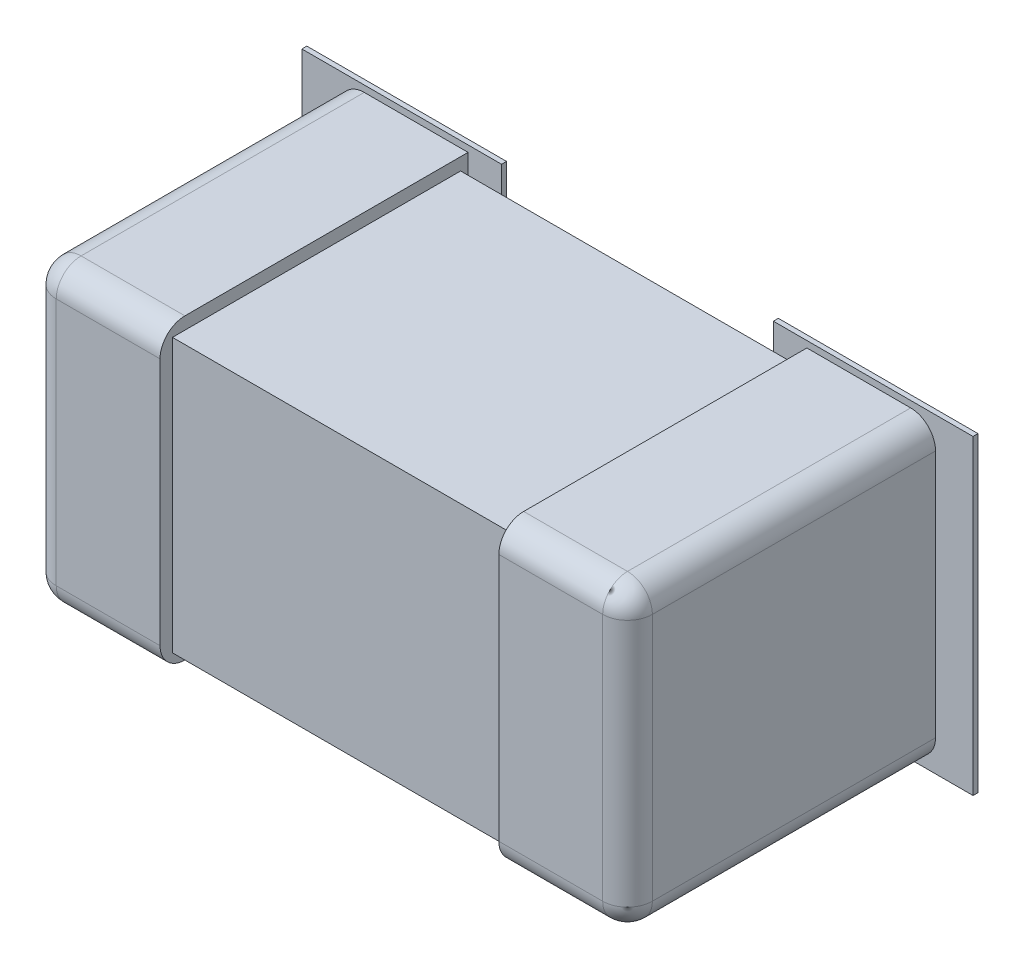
ISO-10303-21;
HEADER;
FILE_DESCRIPTION(('STEP AP214'),'2;1');
FILE_NAME('part.step','',(''),(''),'','','');
FILE_SCHEMA(('AUTOMOTIVE_DESIGN { 1 0 10303 214 1 1 1 1 }'));
ENDSEC;
DATA;
#1=APPLICATION_CONTEXT('core data for automotive mechanical design processes');
#2=APPLICATION_PROTOCOL_DEFINITION('international standard','automotive_design',2000,#1);
#3=PRODUCT_CONTEXT('',#1,'mechanical');
#4=PRODUCT('Part','Part','',(#3));
#5=PRODUCT_RELATED_PRODUCT_CATEGORY('part','',(#4));
#6=PRODUCT_DEFINITION_FORMATION('','',#4);
#7=PRODUCT_DEFINITION_CONTEXT('part definition',#1,'design');
#8=PRODUCT_DEFINITION('design','',#6,#7);
#9=PRODUCT_DEFINITION_SHAPE('','',#8);
#10=(LENGTH_UNIT() NAMED_UNIT(*) SI_UNIT(.MILLI.,.METRE.));
#11=(NAMED_UNIT(*) PLANE_ANGLE_UNIT() SI_UNIT($,.RADIAN.));
#12=(NAMED_UNIT(*) SI_UNIT($,.STERADIAN.) SOLID_ANGLE_UNIT());
#13=UNCERTAINTY_MEASURE_WITH_UNIT(LENGTH_MEASURE(1.E-05),#10,'distance_accuracy_value','');
#14=(GEOMETRIC_REPRESENTATION_CONTEXT(3) GLOBAL_UNCERTAINTY_ASSIGNED_CONTEXT((#13)) GLOBAL_UNIT_ASSIGNED_CONTEXT((#10,
#11,#12)) REPRESENTATION_CONTEXT('',''));
#15=CARTESIAN_POINT('',(0.,0.,0.));
#16=DIRECTION('',(0.,0.,1.));
#17=DIRECTION('',(1.,0.,0.));
#18=AXIS2_PLACEMENT_3D('',#15,#16,#17);
#19=CARTESIAN_POINT('',(0.,0.,0.0762));
#20=DIRECTION('',(0.,0.,1.));
#21=DIRECTION('',(1.,0.,0.));
#22=AXIS2_PLACEMENT_3D('',#19,#20,#21);
#23=PLANE('',#22);
#24=DIRECTION('',(1.,0.,0.));
#25=VECTOR('',#24,1.);
#26=CARTESIAN_POINT('',(0.138938,-0.159004,0.0762));
#27=LINE('',#26,#25);
#28=CARTESIAN_POINT('',(0.138938,-0.159004,0.0762));
#29=VERTEX_POINT('',#28);
#30=CARTESIAN_POINT('',(0.343154,-0.159004,0.0762));
#31=VERTEX_POINT('',#30);
#32=EDGE_CURVE('E330',#29,#31,#27,.T.);
#33=ORIENTED_EDGE('',*,*,#32,.F.);
#34=DIRECTION('',(0.,1.,0.));
#35=VECTOR('',#34,1.);
#36=CARTESIAN_POINT('',(0.138938,0.159004,0.0762));
#37=LINE('',#36,#35);
#38=CARTESIAN_POINT('',(0.138938,0.159004,0.0762));
#39=VERTEX_POINT('',#38);
#40=EDGE_CURVE('E335',#39,#29,#37,.F.);
#41=ORIENTED_EDGE('',*,*,#40,.F.);
#42=DIRECTION('',(1.,0.,0.));
#43=VECTOR('',#42,1.);
#44=CARTESIAN_POINT('',(0.343154,0.159004,0.0762));
#45=LINE('',#44,#43);
#46=CARTESIAN_POINT('',(0.343154,0.159004,0.0762));
#47=VERTEX_POINT('',#46);
#48=EDGE_CURVE('E319',#47,#39,#45,.F.);
#49=ORIENTED_EDGE('',*,*,#48,.F.);
#50=DIRECTION('',(0.,1.,0.));
#51=VECTOR('',#50,1.);
#52=CARTESIAN_POINT('',(0.343154,-0.159004,0.0762));
#53=LINE('',#52,#51);
#54=EDGE_CURVE('E95',#31,#47,#53,.T.);
#55=ORIENTED_EDGE('',*,*,#54,.F.);
#56=EDGE_LOOP('',(#33,#41,#49,#55));
#57=FACE_BOUND('',#56,.T.);
#58=ADVANCED_FACE('F16',(#57),#23,.F.);
#59=CARTESIAN_POINT('',(0.,0.,0.0762));
#60=DIRECTION('',(0.,0.,1.));
#61=DIRECTION('',(1.,0.,0.));
#62=AXIS2_PLACEMENT_3D('',#59,#60,#61);
#63=PLANE('',#62);
#64=DIRECTION('',(1.,0.,0.));
#65=VECTOR('',#64,1.);
#66=CARTESIAN_POINT('',(-0.138938,0.159004,0.0762));
#67=LINE('',#66,#65);
#68=CARTESIAN_POINT('',(-0.138938,0.159004,0.0762));
#69=VERTEX_POINT('',#68);
#70=CARTESIAN_POINT('',(-0.343154,0.159004,0.0762));
#71=VERTEX_POINT('',#70);
#72=EDGE_CURVE('E278',#69,#71,#67,.F.);
#73=ORIENTED_EDGE('',*,*,#72,.F.);
#74=DIRECTION('',(0.,1.,0.));
#75=VECTOR('',#74,1.);
#76=CARTESIAN_POINT('',(-0.138938,-0.159004,0.0762));
#77=LINE('',#76,#75);
#78=CARTESIAN_POINT('',(-0.138938,-0.159004,0.0762));
#79=VERTEX_POINT('',#78);
#80=EDGE_CURVE('E284',#79,#69,#77,.T.);
#81=ORIENTED_EDGE('',*,*,#80,.F.);
#82=DIRECTION('',(1.,0.,0.));
#83=VECTOR('',#82,1.);
#84=CARTESIAN_POINT('',(-0.343154,-0.159004,0.0762));
#85=LINE('',#84,#83);
#86=CARTESIAN_POINT('',(-0.343154,-0.159004,0.0762));
#87=VERTEX_POINT('',#86);
#88=EDGE_CURVE('E263',#87,#79,#85,.T.);
#89=ORIENTED_EDGE('',*,*,#88,.F.);
#90=DIRECTION('',(0.,1.,0.));
#91=VECTOR('',#90,1.);
#92=CARTESIAN_POINT('',(-0.343154,0.159004,0.0762));
#93=LINE('',#92,#91);
#94=EDGE_CURVE('E272',#71,#87,#93,.F.);
#95=ORIENTED_EDGE('',*,*,#94,.F.);
#96=EDGE_LOOP('',(#73,#81,#89,#95));
#97=FACE_BOUND('',#96,.T.);
#98=ADVANCED_FACE('F663',(#97),#63,.F.);
#99=CARTESIAN_POINT('',(0.138938,0.159004,0.0762));
#100=DIRECTION('',(-1.,0.,0.));
#101=DIRECTION('',(0.,0.,1.));
#102=AXIS2_PLACEMENT_3D('',#99,#100,#101);
#103=PLANE('',#102);
#104=DIRECTION('',(0.,0.,1.));
#105=VECTOR('',#104,1.);
#106=CARTESIAN_POINT('',(0.138938,0.159004,0.0762));
#107=LINE('',#106,#105);
#108=CARTESIAN_POINT('',(0.138938,0.159004,0.08128));
#109=VERTEX_POINT('',#108);
#110=EDGE_CURVE('E324',#39,#109,#107,.T.);
#111=ORIENTED_EDGE('',*,*,#110,.F.);
#112=ORIENTED_EDGE('',*,*,#40,.T.);
#113=DIRECTION('',(0.,0.,-1.));
#114=VECTOR('',#113,1.);
#115=CARTESIAN_POINT('',(0.138938,-0.159004,0.0762));
#116=LINE('',#115,#114);
#117=CARTESIAN_POINT('',(0.138938,-0.159004,0.08128));
#118=VERTEX_POINT('',#117);
#119=EDGE_CURVE('E332',#118,#29,#116,.T.);
#120=ORIENTED_EDGE('',*,*,#119,.F.);
#121=DIRECTION('',(0.,1.,0.));
#122=VECTOR('',#121,1.);
#123=CARTESIAN_POINT('',(0.138938,0.,0.08128));
#124=LINE('',#123,#122);
#125=EDGE_CURVE('E216',#109,#118,#124,.F.);
#126=ORIENTED_EDGE('',*,*,#125,.F.);
#127=EDGE_LOOP('',(#111,#112,#120,#126));
#128=FACE_BOUND('',#127,.T.);
#129=ADVANCED_FACE('F669',(#128),#103,.T.);
#130=CARTESIAN_POINT('',(0.138938,-0.159004,0.0762));
#131=DIRECTION('',(0.,-1.,0.));
#132=DIRECTION('',(0.,0.,-1.));
#133=AXIS2_PLACEMENT_3D('',#130,#131,#132);
#134=PLANE('',#133);
#135=ORIENTED_EDGE('',*,*,#119,.T.);
#136=ORIENTED_EDGE('',*,*,#32,.T.);
#137=DIRECTION('',(0.,0.,-1.));
#138=VECTOR('',#137,1.);
#139=CARTESIAN_POINT('',(0.343154,-0.159004,0.0762));
#140=LINE('',#139,#138);
#141=CARTESIAN_POINT('',(0.343154,-0.159004,0.08128));
#142=VERTEX_POINT('',#141);
#143=EDGE_CURVE('E328',#142,#31,#140,.T.);
#144=ORIENTED_EDGE('',*,*,#143,.F.);
#145=DIRECTION('',(1.,0.,0.));
#146=VECTOR('',#145,1.);
#147=CARTESIAN_POINT('',(0.,-0.159004,0.08128));
#148=LINE('',#147,#146);
#149=EDGE_CURVE('E213',#118,#142,#148,.T.);
#150=ORIENTED_EDGE('',*,*,#149,.F.);
#151=EDGE_LOOP('',(#135,#136,#144,#150));
#152=FACE_BOUND('',#151,.T.);
#153=ADVANCED_FACE('F714',(#152),#134,.T.);
#154=CARTESIAN_POINT('',(0.343154,-0.159004,0.0762));
#155=DIRECTION('',(1.,0.,0.));
#156=DIRECTION('',(0.,0.,-1.));
#157=AXIS2_PLACEMENT_3D('',#154,#155,#156);
#158=PLANE('',#157);
#159=ORIENTED_EDGE('',*,*,#143,.T.);
#160=ORIENTED_EDGE('',*,*,#54,.T.);
#161=DIRECTION('',(0.,0.,1.));
#162=VECTOR('',#161,1.);
#163=CARTESIAN_POINT('',(0.343154,0.159004,0.0762));
#164=LINE('',#163,#162);
#165=CARTESIAN_POINT('',(0.343154,0.159004,0.08128));
#166=VERTEX_POINT('',#165);
#167=EDGE_CURVE('E322',#166,#47,#164,.F.);
#168=ORIENTED_EDGE('',*,*,#167,.F.);
#169=DIRECTION('',(0.,1.,0.));
#170=VECTOR('',#169,1.);
#171=CARTESIAN_POINT('',(0.343154,0.,0.08128));
#172=LINE('',#171,#170);
#173=EDGE_CURVE('E210',#142,#166,#172,.T.);
#174=ORIENTED_EDGE('',*,*,#173,.F.);
#175=EDGE_LOOP('',(#159,#160,#168,#174));
#176=FACE_BOUND('',#175,.T.);
#177=ADVANCED_FACE('F721',(#176),#158,.T.);
#178=CARTESIAN_POINT('',(0.343154,0.159004,0.0762));
#179=DIRECTION('',(0.,1.,0.));
#180=DIRECTION('',(0.,0.,1.));
#181=AXIS2_PLACEMENT_3D('',#178,#179,#180);
#182=PLANE('',#181);
#183=ORIENTED_EDGE('',*,*,#167,.T.);
#184=ORIENTED_EDGE('',*,*,#48,.T.);
#185=ORIENTED_EDGE('',*,*,#110,.T.);
#186=DIRECTION('',(1.,0.,0.));
#187=VECTOR('',#186,1.);
#188=CARTESIAN_POINT('',(0.,0.159004,0.08128));
#189=LINE('',#188,#187);
#190=EDGE_CURVE('E207',#166,#109,#189,.F.);
#191=ORIENTED_EDGE('',*,*,#190,.F.);
#192=EDGE_LOOP('',(#183,#184,#185,#191));
#193=FACE_BOUND('',#192,.T.);
#194=ADVANCED_FACE('F729',(#193),#182,.T.);
#195=CARTESIAN_POINT('',(0.3048,-0.1524,0.0762));
#196=DIRECTION('',(1.,0.,0.));
#197=DIRECTION('',(0.,0.,-1.));
#198=AXIS2_PLACEMENT_3D('',#195,#196,#197);
#199=PLANE('',#198);
#200=DIRECTION('',(0.,0.,-1.));
#201=VECTOR('',#200,1.);
#202=CARTESIAN_POINT('',(0.3048,-0.127,0.813444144));
#203=LINE('',#202,#201);
#204=CARTESIAN_POINT('',(0.3048,-0.127,0.08128));
#205=VERTEX_POINT('',#204);
#206=CARTESIAN_POINT('',(0.3048,-0.127,0.37084));
#207=VERTEX_POINT('',#206);
#208=EDGE_CURVE('E315',#205,#207,#203,.F.);
#209=ORIENTED_EDGE('',*,*,#208,.F.);
#210=DIRECTION('',(0.,1.,0.));
#211=VECTOR('',#210,1.);
#212=CARTESIAN_POINT('',(0.3048,0.,0.08128));
#213=LINE('',#212,#211);
#214=CARTESIAN_POINT('',(0.3048,0.127,0.08128));
#215=VERTEX_POINT('',#214);
#216=EDGE_CURVE('E205',#215,#205,#213,.F.);
#217=ORIENTED_EDGE('',*,*,#216,.F.);
#218=DIRECTION('',(0.,0.,-1.));
#219=VECTOR('',#218,1.);
#220=CARTESIAN_POINT('',(0.3048,0.127,0.813444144));
#221=LINE('',#220,#219);
#222=CARTESIAN_POINT('',(0.3048,0.127,0.37084));
#223=VERTEX_POINT('',#222);
#224=EDGE_CURVE('E86',#223,#215,#221,.T.);
#225=ORIENTED_EDGE('',*,*,#224,.F.);
#226=DIRECTION('',(0.,1.,0.));
#227=VECTOR('',#226,1.);
#228=CARTESIAN_POINT('',(0.3048,-0.5735592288,0.37084));
#229=LINE('',#228,#227);
#230=EDGE_CURVE('E341',#207,#223,#229,.T.);
#231=ORIENTED_EDGE('',*,*,#230,.F.);
#232=EDGE_LOOP('',(#209,#217,#225,#231));
#233=FACE_BOUND('',#232,.T.);
#234=ADVANCED_FACE('F736',(#233),#199,.T.);
#235=CARTESIAN_POINT('',(0.2794,0.127,0.813444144));
#236=DIRECTION('',(0.,0.,-1.));
#237=DIRECTION('',(-1.,0.,0.));
#238=AXIS2_PLACEMENT_3D('',#235,#236,#237);
#239=CYLINDRICAL_SURFACE('',#238,0.0254);
#240=ORIENTED_EDGE('',*,*,#224,.T.);
#241=CARTESIAN_POINT('',(0.2794,0.127,0.08128));
#242=DIRECTION('',(0.,0.,-1.));
#243=DIRECTION('',(-1.,0.,0.));
#244=AXIS2_PLACEMENT_3D('',#241,#242,#243);
#245=CIRCLE('',#244,0.0254);
#246=CARTESIAN_POINT('',(0.2794,0.1524,0.08128));
#247=VERTEX_POINT('',#246);
#248=EDGE_CURVE('E185',#247,#215,#245,.T.);
#249=ORIENTED_EDGE('',*,*,#248,.F.);
#250=DIRECTION('',(0.,0.,1.));
#251=VECTOR('',#250,1.);
#252=CARTESIAN_POINT('',(0.2794,0.1524,0.0762));
#253=LINE('',#252,#251);
#254=CARTESIAN_POINT('',(0.2794,0.1524,0.37084));
#255=VERTEX_POINT('',#254);
#256=EDGE_CURVE('E162',#255,#247,#253,.F.);
#257=ORIENTED_EDGE('',*,*,#256,.F.);
#258=CARTESIAN_POINT('',(0.2794,0.127,0.37084));
#259=DIRECTION('',(0.,0.,-1.));
#260=DIRECTION('',(-1.,0.,0.));
#261=AXIS2_PLACEMENT_3D('',#258,#259,#260);
#262=CIRCLE('',#261,0.0254);
#263=EDGE_CURVE('E19',#223,#255,#262,.F.);
#264=ORIENTED_EDGE('',*,*,#263,.F.);
#265=EDGE_LOOP('',(#240,#249,#257,#264));
#266=FACE_BOUND('',#265,.T.);
#267=ADVANCED_FACE('F183',(#266),#239,.T.);
#268=CARTESIAN_POINT('',(0.2794,0.127,0.37084));
#269=DIRECTION('',(0.,0.707106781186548,0.707106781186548));
#270=DIRECTION('',(1.,0.,0.));
#271=AXIS2_PLACEMENT_3D('',#268,#269,#270);
#272=SPHERICAL_SURFACE('',#271,0.0254);
#273=CARTESIAN_POINT('',(0.2794,0.127,0.37084));
#274=DIRECTION('',(-1.,0.,0.));
#275=DIRECTION('',(0.,0.,1.));
#276=AXIS2_PLACEMENT_3D('',#273,#274,#275);
#277=CIRCLE('',#276,0.0254);
#278=CARTESIAN_POINT('',(0.2794,0.127,0.39624));
#279=VERTEX_POINT('',#278);
#280=CARTESIAN_POINT('',(0.2794,0.144960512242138,0.388800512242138));
#281=VERTEX_POINT('',#280);
#282=EDGE_CURVE('E181',#279,#281,#277,.T.);
#283=ORIENTED_EDGE('',*,*,#282,.F.);
#284=CARTESIAN_POINT('',(0.2794,0.127,0.37084));
#285=DIRECTION('',(0.,1.,0.));
#286=DIRECTION('',(0.,0.,1.));
#287=AXIS2_PLACEMENT_3D('',#284,#285,#286);
#288=CIRCLE('',#287,0.0254);
#289=EDGE_CURVE('E172',#223,#279,#288,.F.);
#290=ORIENTED_EDGE('',*,*,#289,.F.);
#291=ORIENTED_EDGE('',*,*,#263,.T.);
#292=CARTESIAN_POINT('',(0.2794,0.127,0.37084));
#293=DIRECTION('',(-1.,0.,0.));
#294=DIRECTION('',(0.,0.,1.));
#295=AXIS2_PLACEMENT_3D('',#292,#293,#294);
#296=CIRCLE('',#295,0.0254);
#297=EDGE_CURVE('E171',#281,#255,#296,.T.);
#298=ORIENTED_EDGE('',*,*,#297,.F.);
#299=EDGE_LOOP('',(#283,#290,#291,#298));
#300=FACE_BOUND('',#299,.T.);
#301=ADVANCED_FACE('F170',(#300),#272,.T.);
#302=CARTESIAN_POINT('',(0.2794,-0.5735592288,0.37084));
#303=DIRECTION('',(0.,1.,0.));
#304=DIRECTION('',(0.,0.,1.));
#305=AXIS2_PLACEMENT_3D('',#302,#303,#304);
#306=CYLINDRICAL_SURFACE('',#305,0.0254);
#307=CARTESIAN_POINT('',(0.2794,-0.127,0.37084));
#308=DIRECTION('',(0.,1.,0.));
#309=DIRECTION('',(0.,0.,1.));
#310=AXIS2_PLACEMENT_3D('',#307,#308,#309);
#311=CIRCLE('',#310,0.0254);
#312=CARTESIAN_POINT('',(0.297360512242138,-0.127,0.388800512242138));
#313=VERTEX_POINT('',#312);
#314=EDGE_CURVE('E343',#207,#313,#311,.F.);
#315=ORIENTED_EDGE('',*,*,#314,.F.);
#316=ORIENTED_EDGE('',*,*,#230,.T.);
#317=ORIENTED_EDGE('',*,*,#289,.T.);
#318=DIRECTION('',(0.,1.,0.));
#319=VECTOR('',#318,1.);
#320=CARTESIAN_POINT('',(0.2794,0.,0.39624));
#321=LINE('',#320,#319);
#322=CARTESIAN_POINT('',(0.2794,-0.127,0.39624));
#323=VERTEX_POINT('',#322);
#324=EDGE_CURVE('E194',#323,#279,#321,.T.);
#325=ORIENTED_EDGE('',*,*,#324,.F.);
#326=CARTESIAN_POINT('',(0.2794,-0.127,0.37084));
#327=DIRECTION('',(0.,-1.,0.));
#328=DIRECTION('',(0.707106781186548,0.,0.707106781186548));
#329=AXIS2_PLACEMENT_3D('',#326,#327,#328);
#330=CIRCLE('',#329,0.0254);
#331=EDGE_CURVE('E295',#313,#323,#330,.T.);
#332=ORIENTED_EDGE('',*,*,#331,.F.);
#333=EDGE_LOOP('',(#315,#316,#317,#325,#332));
#334=FACE_BOUND('',#333,.T.);
#335=ADVANCED_FACE('F303',(#334),#306,.T.);
#336=CARTESIAN_POINT('',(0.2794,-0.127,0.37084));
#337=DIRECTION('',(0.707106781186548,0.,0.707106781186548));
#338=DIRECTION('',(0.,-1.,0.));
#339=AXIS2_PLACEMENT_3D('',#336,#337,#338);
#340=SPHERICAL_SURFACE('',#339,0.0254);
#341=ORIENTED_EDGE('',*,*,#331,.T.);
#342=CARTESIAN_POINT('',(0.2794,-0.127,0.37084));
#343=DIRECTION('',(1.,0.,0.));
#344=DIRECTION('',(0.,0.,-1.));
#345=AXIS2_PLACEMENT_3D('',#342,#343,#344);
#346=CIRCLE('',#345,0.0254);
#347=CARTESIAN_POINT('',(0.2794,-0.1524,0.37084));
#348=VERTEX_POINT('',#347);
#349=EDGE_CURVE('E373',#348,#323,#346,.F.);
#350=ORIENTED_EDGE('',*,*,#349,.F.);
#351=CARTESIAN_POINT('',(0.2794,-0.127,0.37084));
#352=DIRECTION('',(0.,0.,-1.));
#353=DIRECTION('',(-1.,0.,0.));
#354=AXIS2_PLACEMENT_3D('',#351,#352,#353);
#355=CIRCLE('',#354,0.0254);
#356=EDGE_CURVE('E287',#207,#348,#355,.T.);
#357=ORIENTED_EDGE('',*,*,#356,.F.);
#358=ORIENTED_EDGE('',*,*,#314,.T.);
#359=EDGE_LOOP('',(#341,#350,#357,#358));
#360=FACE_BOUND('',#359,.T.);
#361=ADVANCED_FACE('F298',(#360),#340,.T.);
#362=CARTESIAN_POINT('',(0.2794,-0.127,0.813444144));
#363=DIRECTION('',(0.,0.,-1.));
#364=DIRECTION('',(-1.,0.,0.));
#365=AXIS2_PLACEMENT_3D('',#362,#363,#364);
#366=CYLINDRICAL_SURFACE('',#365,0.0254);
#367=DIRECTION('',(0.,0.,-1.));
#368=VECTOR('',#367,1.);
#369=CARTESIAN_POINT('',(0.2794,-0.1524,0.0762));
#370=LINE('',#369,#368);
#371=CARTESIAN_POINT('',(0.2794,-0.1524,0.08128));
#372=VERTEX_POINT('',#371);
#373=EDGE_CURVE('E288',#372,#348,#370,.F.);
#374=ORIENTED_EDGE('',*,*,#373,.F.);
#375=CARTESIAN_POINT('',(0.2794,-0.127,0.08128));
#376=DIRECTION('',(0.,0.,-1.));
#377=DIRECTION('',(-1.,0.,0.));
#378=AXIS2_PLACEMENT_3D('',#375,#376,#377);
#379=CIRCLE('',#378,0.0254);
#380=EDGE_CURVE('E188',#205,#372,#379,.T.);
#381=ORIENTED_EDGE('',*,*,#380,.F.);
#382=ORIENTED_EDGE('',*,*,#208,.T.);
#383=ORIENTED_EDGE('',*,*,#356,.T.);
#384=EDGE_LOOP('',(#374,#381,#382,#383));
#385=FACE_BOUND('',#384,.T.);
#386=ADVANCED_FACE('F302',(#385),#366,.T.);
#387=CARTESIAN_POINT('',(-0.138938,-0.159004,0.0762));
#388=DIRECTION('',(1.,0.,0.));
#389=DIRECTION('',(0.,0.,-1.));
#390=AXIS2_PLACEMENT_3D('',#387,#388,#389);
#391=PLANE('',#390);
#392=DIRECTION('',(0.,0.,-1.));
#393=VECTOR('',#392,1.);
#394=CARTESIAN_POINT('',(-0.138938,-0.159004,0.0762));
#395=LINE('',#394,#393);
#396=CARTESIAN_POINT('',(-0.138938,-0.159004,0.08128));
#397=VERTEX_POINT('',#396);
#398=EDGE_CURVE('E269',#79,#397,#395,.F.);
#399=ORIENTED_EDGE('',*,*,#398,.F.);
#400=ORIENTED_EDGE('',*,*,#80,.T.);
#401=DIRECTION('',(0.,0.,1.));
#402=VECTOR('',#401,1.);
#403=CARTESIAN_POINT('',(-0.138938,0.159004,0.0762));
#404=LINE('',#403,#402);
#405=CARTESIAN_POINT('',(-0.138938,0.159004,0.08128));
#406=VERTEX_POINT('',#405);
#407=EDGE_CURVE('E281',#406,#69,#404,.F.);
#408=ORIENTED_EDGE('',*,*,#407,.F.);
#409=DIRECTION('',(0.,1.,0.));
#410=VECTOR('',#409,1.);
#411=CARTESIAN_POINT('',(-0.138938,0.,0.08128));
#412=LINE('',#411,#410);
#413=EDGE_CURVE('E438',#397,#406,#412,.T.);
#414=ORIENTED_EDGE('',*,*,#413,.F.);
#415=EDGE_LOOP('',(#399,#400,#408,#414));
#416=FACE_BOUND('',#415,.T.);
#417=ADVANCED_FACE('F766',(#416),#391,.T.);
#418=CARTESIAN_POINT('',(-0.138938,0.159004,0.0762));
#419=DIRECTION('',(0.,1.,0.));
#420=DIRECTION('',(0.,0.,1.));
#421=AXIS2_PLACEMENT_3D('',#418,#419,#420);
#422=PLANE('',#421);
#423=ORIENTED_EDGE('',*,*,#407,.T.);
#424=ORIENTED_EDGE('',*,*,#72,.T.);
#425=DIRECTION('',(0.,0.,1.));
#426=VECTOR('',#425,1.);
#427=CARTESIAN_POINT('',(-0.343154,0.159004,0.0762));
#428=LINE('',#427,#426);
#429=CARTESIAN_POINT('',(-0.343154,0.159004,0.08128));
#430=VERTEX_POINT('',#429);
#431=EDGE_CURVE('E275',#430,#71,#428,.F.);
#432=ORIENTED_EDGE('',*,*,#431,.F.);
#433=DIRECTION('',(1.,0.,0.));
#434=VECTOR('',#433,1.);
#435=CARTESIAN_POINT('',(0.,0.159004,0.08128));
#436=LINE('',#435,#434);
#437=EDGE_CURVE('E435',#406,#430,#436,.F.);
#438=ORIENTED_EDGE('',*,*,#437,.F.);
#439=EDGE_LOOP('',(#423,#424,#432,#438));
#440=FACE_BOUND('',#439,.T.);
#441=ADVANCED_FACE('F772',(#440),#422,.T.);
#442=CARTESIAN_POINT('',(-0.343154,0.159004,0.0762));
#443=DIRECTION('',(-1.,0.,0.));
#444=DIRECTION('',(0.,0.,1.));
#445=AXIS2_PLACEMENT_3D('',#442,#443,#444);
#446=PLANE('',#445);
#447=ORIENTED_EDGE('',*,*,#431,.T.);
#448=ORIENTED_EDGE('',*,*,#94,.T.);
#449=DIRECTION('',(0.,0.,-1.));
#450=VECTOR('',#449,1.);
#451=CARTESIAN_POINT('',(-0.343154,-0.159004,0.0762));
#452=LINE('',#451,#450);
#453=CARTESIAN_POINT('',(-0.343154,-0.159004,0.08128));
#454=VERTEX_POINT('',#453);
#455=EDGE_CURVE('E266',#454,#87,#452,.T.);
#456=ORIENTED_EDGE('',*,*,#455,.F.);
#457=DIRECTION('',(0.,1.,0.));
#458=VECTOR('',#457,1.);
#459=CARTESIAN_POINT('',(-0.343154,0.,0.08128));
#460=LINE('',#459,#458);
#461=EDGE_CURVE('E432',#430,#454,#460,.F.);
#462=ORIENTED_EDGE('',*,*,#461,.F.);
#463=EDGE_LOOP('',(#447,#448,#456,#462));
#464=FACE_BOUND('',#463,.T.);
#465=ADVANCED_FACE('F779',(#464),#446,.T.);
#466=CARTESIAN_POINT('',(-0.343154,-0.159004,0.0762));
#467=DIRECTION('',(0.,-1.,0.));
#468=DIRECTION('',(0.,0.,-1.));
#469=AXIS2_PLACEMENT_3D('',#466,#467,#468);
#470=PLANE('',#469);
#471=ORIENTED_EDGE('',*,*,#455,.T.);
#472=ORIENTED_EDGE('',*,*,#88,.T.);
#473=ORIENTED_EDGE('',*,*,#398,.T.);
#474=DIRECTION('',(1.,0.,0.));
#475=VECTOR('',#474,1.);
#476=CARTESIAN_POINT('',(0.,-0.159004,0.08128));
#477=LINE('',#476,#475);
#478=EDGE_CURVE('E372',#454,#397,#477,.T.);
#479=ORIENTED_EDGE('',*,*,#478,.F.);
#480=EDGE_LOOP('',(#471,#472,#473,#479));
#481=FACE_BOUND('',#480,.T.);
#482=ADVANCED_FACE('F787',(#481),#470,.T.);
#483=CARTESIAN_POINT('',(-0.3048,0.1524,0.0762));
#484=DIRECTION('',(-1.,0.,0.));
#485=DIRECTION('',(0.,0.,1.));
#486=AXIS2_PLACEMENT_3D('',#483,#484,#485);
#487=PLANE('',#486);
#488=DIRECTION('',(0.,0.,-1.));
#489=VECTOR('',#488,1.);
#490=CARTESIAN_POINT('',(-0.3048,0.127,0.813444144));
#491=LINE('',#490,#489);
#492=CARTESIAN_POINT('',(-0.3048,0.127,0.08128));
#493=VERTEX_POINT('',#492);
#494=CARTESIAN_POINT('',(-0.3048,0.127,0.37084));
#495=VERTEX_POINT('',#494);
#496=EDGE_CURVE('E226',#493,#495,#491,.F.);
#497=ORIENTED_EDGE('',*,*,#496,.F.);
#498=DIRECTION('',(0.,1.,0.));
#499=VECTOR('',#498,1.);
#500=CARTESIAN_POINT('',(-0.3048,0.,0.08128));
#501=LINE('',#500,#499);
#502=CARTESIAN_POINT('',(-0.3048,-0.127,0.08128));
#503=VERTEX_POINT('',#502);
#504=EDGE_CURVE('E368',#503,#493,#501,.T.);
#505=ORIENTED_EDGE('',*,*,#504,.F.);
#506=DIRECTION('',(0.,0.,-1.));
#507=VECTOR('',#506,1.);
#508=CARTESIAN_POINT('',(-0.3048,-0.127,0.813444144));
#509=LINE('',#508,#507);
#510=CARTESIAN_POINT('',(-0.3048,-0.127,0.37084));
#511=VERTEX_POINT('',#510);
#512=EDGE_CURVE('E260',#511,#503,#509,.T.);
#513=ORIENTED_EDGE('',*,*,#512,.F.);
#514=DIRECTION('',(0.,-1.,0.));
#515=VECTOR('',#514,1.);
#516=CARTESIAN_POINT('',(-0.3048,0.5735592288,0.37084));
#517=LINE('',#516,#515);
#518=EDGE_CURVE('E337',#495,#511,#517,.T.);
#519=ORIENTED_EDGE('',*,*,#518,.F.);
#520=EDGE_LOOP('',(#497,#505,#513,#519));
#521=FACE_BOUND('',#520,.T.);
#522=ADVANCED_FACE('F795',(#521),#487,.T.);
#523=CARTESIAN_POINT('',(-0.2794,-0.127,0.813444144));
#524=DIRECTION('',(0.,0.,-1.));
#525=DIRECTION('',(-1.,0.,0.));
#526=AXIS2_PLACEMENT_3D('',#523,#524,#525);
#527=CYLINDRICAL_SURFACE('',#526,0.0254);
#528=ORIENTED_EDGE('',*,*,#512,.T.);
#529=CARTESIAN_POINT('',(-0.2794,-0.127,0.08128));
#530=DIRECTION('',(0.,0.,-1.));
#531=DIRECTION('',(-1.,0.,0.));
#532=AXIS2_PLACEMENT_3D('',#529,#530,#531);
#533=CIRCLE('',#532,0.0254);
#534=CARTESIAN_POINT('',(-0.2794,-0.1524,0.08128));
#535=VERTEX_POINT('',#534);
#536=EDGE_CURVE('E369',#535,#503,#533,.T.);
#537=ORIENTED_EDGE('',*,*,#536,.F.);
#538=DIRECTION('',(0.,0.,-1.));
#539=VECTOR('',#538,1.);
#540=CARTESIAN_POINT('',(-0.2794,-0.1524,0.0762));
#541=LINE('',#540,#539);
#542=CARTESIAN_POINT('',(-0.2794,-0.1524,0.37084));
#543=VERTEX_POINT('',#542);
#544=EDGE_CURVE('E257',#543,#535,#541,.T.);
#545=ORIENTED_EDGE('',*,*,#544,.F.);
#546=CARTESIAN_POINT('',(-0.2794,-0.127,0.37084));
#547=DIRECTION('',(0.,0.,-1.));
#548=DIRECTION('',(-1.,0.,0.));
#549=AXIS2_PLACEMENT_3D('',#546,#547,#548);
#550=CIRCLE('',#549,0.0254);
#551=EDGE_CURVE('E262',#511,#543,#550,.F.);
#552=ORIENTED_EDGE('',*,*,#551,.F.);
#553=EDGE_LOOP('',(#528,#537,#545,#552));
#554=FACE_BOUND('',#553,.T.);
#555=ADVANCED_FACE('F252',(#554),#527,.T.);
#556=CARTESIAN_POINT('',(-0.2794,-0.127,0.37084));
#557=DIRECTION('',(0.,-0.707106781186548,0.707106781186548));
#558=DIRECTION('',(-1.,0.,0.));
#559=AXIS2_PLACEMENT_3D('',#556,#557,#558);
#560=SPHERICAL_SURFACE('',#559,0.0254);
#561=CARTESIAN_POINT('',(-0.2794,-0.127,0.37084));
#562=DIRECTION('',(1.,0.,0.));
#563=DIRECTION('',(0.,0.,-1.));
#564=AXIS2_PLACEMENT_3D('',#561,#562,#563);
#565=CIRCLE('',#564,0.0254);
#566=CARTESIAN_POINT('',(-0.2794,-0.127,0.39624));
#567=VERTEX_POINT('',#566);
#568=CARTESIAN_POINT('',(-0.2794,-0.144960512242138,0.388800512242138));
#569=VERTEX_POINT('',#568);
#570=EDGE_CURVE('E234',#567,#569,#565,.T.);
#571=ORIENTED_EDGE('',*,*,#570,.F.);
#572=CARTESIAN_POINT('',(-0.2794,-0.127,0.37084));
#573=DIRECTION('',(0.,-1.,0.));
#574=DIRECTION('',(0.,0.,-1.));
#575=AXIS2_PLACEMENT_3D('',#572,#573,#574);
#576=CIRCLE('',#575,0.0254);
#577=EDGE_CURVE('E340',#511,#567,#576,.F.);
#578=ORIENTED_EDGE('',*,*,#577,.F.);
#579=ORIENTED_EDGE('',*,*,#551,.T.);
#580=CARTESIAN_POINT('',(-0.2794,-0.127,0.37084));
#581=DIRECTION('',(1.,0.,0.));
#582=DIRECTION('',(0.,0.,-1.));
#583=AXIS2_PLACEMENT_3D('',#580,#581,#582);
#584=CIRCLE('',#583,0.0254);
#585=EDGE_CURVE('E363',#569,#543,#584,.T.);
#586=ORIENTED_EDGE('',*,*,#585,.F.);
#587=EDGE_LOOP('',(#571,#578,#579,#586));
#588=FACE_BOUND('',#587,.T.);
#589=ADVANCED_FACE('F247',(#588),#560,.T.);
#590=CARTESIAN_POINT('',(-0.2794,0.5735592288,0.37084));
#591=DIRECTION('',(0.,-1.,0.));
#592=DIRECTION('',(0.,0.,-1.));
#593=AXIS2_PLACEMENT_3D('',#590,#591,#592);
#594=CYLINDRICAL_SURFACE('',#593,0.0254);
#595=CARTESIAN_POINT('',(-0.2794,0.127,0.37084));
#596=DIRECTION('',(0.,-1.,0.));
#597=DIRECTION('',(0.,0.,-1.));
#598=AXIS2_PLACEMENT_3D('',#595,#596,#597);
#599=CIRCLE('',#598,0.0254);
#600=CARTESIAN_POINT('',(-0.2794,0.127,0.39624));
#601=VERTEX_POINT('',#600);
#602=EDGE_CURVE('E259',#495,#601,#599,.F.);
#603=ORIENTED_EDGE('',*,*,#602,.F.);
#604=ORIENTED_EDGE('',*,*,#518,.T.);
#605=ORIENTED_EDGE('',*,*,#577,.T.);
#606=DIRECTION('',(0.,1.,0.));
#607=VECTOR('',#606,1.);
#608=CARTESIAN_POINT('',(-0.2794,0.,0.39624));
#609=LINE('',#608,#607);
#610=EDGE_CURVE('E227',#601,#567,#609,.F.);
#611=ORIENTED_EDGE('',*,*,#610,.F.);
#612=EDGE_LOOP('',(#603,#604,#605,#611));
#613=FACE_BOUND('',#612,.T.);
#614=ADVANCED_FACE('F242',(#613),#594,.T.);
#615=CARTESIAN_POINT('',(-0.2794,0.127,0.37084));
#616=DIRECTION('',(-0.707106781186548,0.707106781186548,0.));
#617=DIRECTION('',(0.,0.,1.));
#618=AXIS2_PLACEMENT_3D('',#615,#616,#617);
#619=SPHERICAL_SURFACE('',#618,0.0254);
#620=ORIENTED_EDGE('',*,*,#602,.T.);
#621=CARTESIAN_POINT('',(-0.2794,0.127,0.37084));
#622=DIRECTION('',(-1.,0.,0.));
#623=DIRECTION('',(0.,0.,1.));
#624=AXIS2_PLACEMENT_3D('',#621,#622,#623);
#625=CIRCLE('',#624,0.0254);
#626=CARTESIAN_POINT('',(-0.2794,0.1524,0.37084));
#627=VERTEX_POINT('',#626);
#628=EDGE_CURVE('E360',#627,#601,#625,.F.);
#629=ORIENTED_EDGE('',*,*,#628,.F.);
#630=CARTESIAN_POINT('',(-0.2794,0.127,0.37084));
#631=DIRECTION('',(0.,0.,-1.));
#632=DIRECTION('',(-1.,0.,0.));
#633=AXIS2_PLACEMENT_3D('',#630,#631,#632);
#634=CIRCLE('',#633,0.0254);
#635=CARTESIAN_POINT('',(-0.297360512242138,0.144960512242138,0.37084));
#636=VERTEX_POINT('',#635);
#637=EDGE_CURVE('E219',#636,#627,#634,.T.);
#638=ORIENTED_EDGE('',*,*,#637,.F.);
#639=CARTESIAN_POINT('',(-0.2794,0.127,0.37084));
#640=DIRECTION('',(0.,0.,-1.));
#641=DIRECTION('',(-1.,0.,0.));
#642=AXIS2_PLACEMENT_3D('',#639,#640,#641);
#643=CIRCLE('',#642,0.0254);
#644=EDGE_CURVE('E34',#495,#636,#643,.T.);
#645=ORIENTED_EDGE('',*,*,#644,.F.);
#646=EDGE_LOOP('',(#620,#629,#638,#645));
#647=FACE_BOUND('',#646,.T.);
#648=ADVANCED_FACE('F237',(#647),#619,.T.);
#649=CARTESIAN_POINT('',(-0.2794,0.127,0.813444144));
#650=DIRECTION('',(0.,0.,-1.));
#651=DIRECTION('',(-1.,0.,0.));
#652=AXIS2_PLACEMENT_3D('',#649,#650,#651);
#653=CYLINDRICAL_SURFACE('',#652,0.0254);
#654=DIRECTION('',(0.,0.,1.));
#655=VECTOR('',#654,1.);
#656=CARTESIAN_POINT('',(-0.2794,0.1524,0.0762));
#657=LINE('',#656,#655);
#658=CARTESIAN_POINT('',(-0.2794,0.1524,0.08128));
#659=VERTEX_POINT('',#658);
#660=EDGE_CURVE('E220',#659,#627,#657,.T.);
#661=ORIENTED_EDGE('',*,*,#660,.F.);
#662=CARTESIAN_POINT('',(-0.2794,0.127,0.08128));
#663=DIRECTION('',(0.,0.,-1.));
#664=DIRECTION('',(-1.,0.,0.));
#665=AXIS2_PLACEMENT_3D('',#662,#663,#664);
#666=CIRCLE('',#665,0.0254);
#667=EDGE_CURVE('E366',#493,#659,#666,.T.);
#668=ORIENTED_EDGE('',*,*,#667,.F.);
#669=ORIENTED_EDGE('',*,*,#496,.T.);
#670=ORIENTED_EDGE('',*,*,#644,.T.);
#671=ORIENTED_EDGE('',*,*,#637,.T.);
#672=EDGE_LOOP('',(#661,#668,#669,#670,#671));
#673=FACE_BOUND('',#672,.T.);
#674=ADVANCED_FACE('F241',(#673),#653,.T.);
#675=CARTESIAN_POINT('',(0.,0.,0.08128));
#676=DIRECTION('',(0.,0.,1.));
#677=DIRECTION('',(1.,0.,0.));
#678=AXIS2_PLACEMENT_3D('',#675,#676,#677);
#679=PLANE('',#678);
#680=DIRECTION('',(0.,1.,0.));
#681=VECTOR('',#680,1.);
#682=CARTESIAN_POINT('',(0.173228,-0.1524,0.08128));
#683=LINE('',#682,#681);
#684=CARTESIAN_POINT('',(0.173228,-0.1524,0.08128));
#685=VERTEX_POINT('',#684);
#686=CARTESIAN_POINT('',(0.173228,0.1524,0.08128));
#687=VERTEX_POINT('',#686);
#688=EDGE_CURVE('E403',#685,#687,#683,.T.);
#689=ORIENTED_EDGE('',*,*,#688,.T.);
#690=DIRECTION('',(1.,0.,0.));
#691=VECTOR('',#690,1.);
#692=CARTESIAN_POINT('',(0.3048,0.1524,0.08128));
#693=LINE('',#692,#691);
#694=EDGE_CURVE('E187',#247,#687,#693,.F.);
#695=ORIENTED_EDGE('',*,*,#694,.F.);
#696=ORIENTED_EDGE('',*,*,#248,.T.);
#697=ORIENTED_EDGE('',*,*,#216,.T.);
#698=ORIENTED_EDGE('',*,*,#380,.T.);
#699=DIRECTION('',(1.,0.,0.));
#700=VECTOR('',#699,1.);
#701=CARTESIAN_POINT('',(-0.3048,-0.1524,0.08128));
#702=LINE('',#701,#700);
#703=EDGE_CURVE('E441',#685,#372,#702,.T.);
#704=ORIENTED_EDGE('',*,*,#703,.F.);
#705=EDGE_LOOP('',(#689,#695,#696,#697,#698,#704));
#706=FACE_BOUND('',#705,.T.);
#707=ORIENTED_EDGE('',*,*,#173,.T.);
#708=ORIENTED_EDGE('',*,*,#190,.T.);
#709=ORIENTED_EDGE('',*,*,#125,.T.);
#710=ORIENTED_EDGE('',*,*,#149,.T.);
#711=EDGE_LOOP('',(#707,#708,#709,#710));
#712=FACE_BOUND('',#711,.T.);
#713=ADVANCED_FACE('F463',(#706,#712),#679,.T.);
#714=CARTESIAN_POINT('',(0.3048,0.1524,0.0762));
#715=DIRECTION('',(0.,1.,0.));
#716=DIRECTION('',(0.,0.,1.));
#717=AXIS2_PLACEMENT_3D('',#714,#715,#716);
#718=PLANE('',#717);
#719=ORIENTED_EDGE('',*,*,#256,.T.);
#720=ORIENTED_EDGE('',*,*,#694,.T.);
#721=DIRECTION('',(0.,0.,-1.));
#722=VECTOR('',#721,1.);
#723=CARTESIAN_POINT('',(0.173228,0.1524,0.0889));
#724=LINE('',#723,#722);
#725=CARTESIAN_POINT('',(0.173228,0.1524,0.37084));
#726=VERTEX_POINT('',#725);
#727=EDGE_CURVE('E193',#687,#726,#724,.F.);
#728=ORIENTED_EDGE('',*,*,#727,.T.);
#729=DIRECTION('',(-1.,0.,0.));
#730=VECTOR('',#729,1.);
#731=CARTESIAN_POINT('',(1.2378251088,0.1524,0.37084));
#732=LINE('',#731,#730);
#733=EDGE_CURVE('E178',#255,#726,#732,.T.);
#734=ORIENTED_EDGE('',*,*,#733,.F.);
#735=EDGE_LOOP('',(#719,#720,#728,#734));
#736=FACE_BOUND('',#735,.T.);
#737=ADVANCED_FACE('F191',(#736),#718,.T.);
#738=CARTESIAN_POINT('',(1.2378251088,0.127,0.37084));
#739=DIRECTION('',(-1.,0.,0.));
#740=DIRECTION('',(0.,0.,1.));
#741=AXIS2_PLACEMENT_3D('',#738,#739,#740);
#742=CYLINDRICAL_SURFACE('',#741,0.0254);
#743=ORIENTED_EDGE('',*,*,#733,.T.);
#744=CARTESIAN_POINT('',(0.173228,0.127,0.37084));
#745=DIRECTION('',(-1.,0.,0.));
#746=DIRECTION('',(0.,0.,1.));
#747=AXIS2_PLACEMENT_3D('',#744,#745,#746);
#748=CIRCLE('',#747,0.0254);
#749=CARTESIAN_POINT('',(0.173228,0.127,0.39624));
#750=VERTEX_POINT('',#749);
#751=EDGE_CURVE('E358',#726,#750,#748,.F.);
#752=ORIENTED_EDGE('',*,*,#751,.T.);
#753=DIRECTION('',(1.,0.,0.));
#754=VECTOR('',#753,1.);
#755=CARTESIAN_POINT('',(0.,0.127,0.39624));
#756=LINE('',#755,#754);
#757=EDGE_CURVE('E197',#279,#750,#756,.F.);
#758=ORIENTED_EDGE('',*,*,#757,.F.);
#759=ORIENTED_EDGE('',*,*,#282,.T.);
#760=ORIENTED_EDGE('',*,*,#297,.T.);
#761=EDGE_LOOP('',(#743,#752,#758,#759,#760));
#762=FACE_BOUND('',#761,.T.);
#763=ADVANCED_FACE('F176',(#762),#742,.T.);
#764=CARTESIAN_POINT('',(0.,0.,0.39624));
#765=DIRECTION('',(0.,0.,1.));
#766=DIRECTION('',(1.,0.,0.));
#767=AXIS2_PLACEMENT_3D('',#764,#765,#766);
#768=PLANE('',#767);
#769=ORIENTED_EDGE('',*,*,#324,.T.);
#770=ORIENTED_EDGE('',*,*,#757,.T.);
#771=DIRECTION('',(0.,1.,0.));
#772=VECTOR('',#771,1.);
#773=CARTESIAN_POINT('',(0.173228,-0.1524,0.39624));
#774=LINE('',#773,#772);
#775=CARTESIAN_POINT('',(0.173228,-0.127,0.39624));
#776=VERTEX_POINT('',#775);
#777=EDGE_CURVE('E357',#750,#776,#774,.F.);
#778=ORIENTED_EDGE('',*,*,#777,.T.);
#779=DIRECTION('',(1.,0.,0.));
#780=VECTOR('',#779,1.);
#781=CARTESIAN_POINT('',(-1.2378251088,-0.127,0.39624));
#782=LINE('',#781,#780);
#783=EDGE_CURVE('E291',#323,#776,#782,.F.);
#784=ORIENTED_EDGE('',*,*,#783,.F.);
#785=EDGE_LOOP('',(#769,#770,#778,#784));
#786=FACE_BOUND('',#785,.T.);
#787=ADVANCED_FACE('F388',(#786),#768,.T.);
#788=CARTESIAN_POINT('',(-1.2378251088,-0.127,0.37084));
#789=DIRECTION('',(1.,0.,0.));
#790=DIRECTION('',(0.,0.,-1.));
#791=AXIS2_PLACEMENT_3D('',#788,#789,#790);
#792=CYLINDRICAL_SURFACE('',#791,0.0254);
#793=ORIENTED_EDGE('',*,*,#783,.T.);
#794=CARTESIAN_POINT('',(0.173228,-0.127,0.37084));
#795=DIRECTION('',(1.,0.,0.));
#796=DIRECTION('',(0.,0.,-1.));
#797=AXIS2_PLACEMENT_3D('',#794,#795,#796);
#798=CIRCLE('',#797,0.0254);
#799=CARTESIAN_POINT('',(0.173228,-0.1524,0.37084));
#800=VERTEX_POINT('',#799);
#801=EDGE_CURVE('E353',#776,#800,#798,.T.);
#802=ORIENTED_EDGE('',*,*,#801,.T.);
#803=DIRECTION('',(1.,0.,0.));
#804=VECTOR('',#803,1.);
#805=CARTESIAN_POINT('',(-0.3048,-0.1524,0.37084));
#806=LINE('',#805,#804);
#807=EDGE_CURVE('E290',#348,#800,#806,.F.);
#808=ORIENTED_EDGE('',*,*,#807,.F.);
#809=ORIENTED_EDGE('',*,*,#349,.T.);
#810=EDGE_LOOP('',(#793,#802,#808,#809));
#811=FACE_BOUND('',#810,.T.);
#812=ADVANCED_FACE('F450',(#811),#792,.T.);
#813=CARTESIAN_POINT('',(-0.3048,-0.1524,0.0762));
#814=DIRECTION('',(0.,-1.,0.));
#815=DIRECTION('',(0.,0.,-1.));
#816=AXIS2_PLACEMENT_3D('',#813,#814,#815);
#817=PLANE('',#816);
#818=DIRECTION('',(0.,0.,-1.));
#819=VECTOR('',#818,1.);
#820=CARTESIAN_POINT('',(0.173228,-0.1524,0.0889));
#821=LINE('',#820,#819);
#822=EDGE_CURVE('E356',#800,#685,#821,.T.);
#823=ORIENTED_EDGE('',*,*,#822,.T.);
#824=ORIENTED_EDGE('',*,*,#703,.T.);
#825=ORIENTED_EDGE('',*,*,#373,.T.);
#826=ORIENTED_EDGE('',*,*,#807,.T.);
#827=EDGE_LOOP('',(#823,#824,#825,#826));
#828=FACE_BOUND('',#827,.T.);
#829=ADVANCED_FACE('F460',(#828),#817,.T.);
#830=CARTESIAN_POINT('',(0.,0.,0.08128));
#831=DIRECTION('',(0.,0.,1.));
#832=DIRECTION('',(1.,0.,0.));
#833=AXIS2_PLACEMENT_3D('',#830,#831,#832);
#834=PLANE('',#833);
#835=DIRECTION('',(0.,1.,0.));
#836=VECTOR('',#835,1.);
#837=CARTESIAN_POINT('',(-0.173228,-0.1524,0.08128));
#838=LINE('',#837,#836);
#839=CARTESIAN_POINT('',(-0.173228,0.1524,0.08128));
#840=VERTEX_POINT('',#839);
#841=CARTESIAN_POINT('',(-0.173228,-0.1524,0.08128));
#842=VERTEX_POINT('',#841);
#843=EDGE_CURVE('E415',#840,#842,#838,.F.);
#844=ORIENTED_EDGE('',*,*,#843,.T.);
#845=DIRECTION('',(1.,0.,0.));
#846=VECTOR('',#845,1.);
#847=CARTESIAN_POINT('',(-0.3048,-0.1524,0.08128));
#848=LINE('',#847,#846);
#849=EDGE_CURVE('E424',#535,#842,#848,.T.);
#850=ORIENTED_EDGE('',*,*,#849,.F.);
#851=ORIENTED_EDGE('',*,*,#536,.T.);
#852=ORIENTED_EDGE('',*,*,#504,.T.);
#853=ORIENTED_EDGE('',*,*,#667,.T.);
#854=DIRECTION('',(1.,0.,0.));
#855=VECTOR('',#854,1.);
#856=CARTESIAN_POINT('',(0.3048,0.1524,0.08128));
#857=LINE('',#856,#855);
#858=EDGE_CURVE('E409',#840,#659,#857,.F.);
#859=ORIENTED_EDGE('',*,*,#858,.F.);
#860=EDGE_LOOP('',(#844,#850,#851,#852,#853,#859));
#861=FACE_BOUND('',#860,.T.);
#862=ORIENTED_EDGE('',*,*,#461,.T.);
#863=ORIENTED_EDGE('',*,*,#478,.T.);
#864=ORIENTED_EDGE('',*,*,#413,.T.);
#865=ORIENTED_EDGE('',*,*,#437,.T.);
#866=EDGE_LOOP('',(#862,#863,#864,#865));
#867=FACE_BOUND('',#866,.T.);
#868=ADVANCED_FACE('F635',(#861,#867),#834,.T.);
#869=CARTESIAN_POINT('',(-0.3048,-0.1524,0.0762));
#870=DIRECTION('',(0.,-1.,0.));
#871=DIRECTION('',(0.,0.,-1.));
#872=AXIS2_PLACEMENT_3D('',#869,#870,#871);
#873=PLANE('',#872);
#874=ORIENTED_EDGE('',*,*,#544,.T.);
#875=ORIENTED_EDGE('',*,*,#849,.T.);
#876=DIRECTION('',(0.,0.,1.));
#877=VECTOR('',#876,1.);
#878=CARTESIAN_POINT('',(-0.173228,-0.1524,0.0762));
#879=LINE('',#878,#877);
#880=CARTESIAN_POINT('',(-0.173228,-0.1524,0.37084));
#881=VERTEX_POINT('',#880);
#882=EDGE_CURVE('E352',#842,#881,#879,.T.);
#883=ORIENTED_EDGE('',*,*,#882,.T.);
#884=DIRECTION('',(1.,0.,0.));
#885=VECTOR('',#884,1.);
#886=CARTESIAN_POINT('',(-1.2378251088,-0.1524,0.37084));
#887=LINE('',#886,#885);
#888=EDGE_CURVE('E231',#543,#881,#887,.T.);
#889=ORIENTED_EDGE('',*,*,#888,.F.);
#890=EDGE_LOOP('',(#874,#875,#883,#889));
#891=FACE_BOUND('',#890,.T.);
#892=ADVANCED_FACE('F641',(#891),#873,.T.);
#893=CARTESIAN_POINT('',(-1.2378251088,-0.127,0.37084));
#894=DIRECTION('',(1.,0.,0.));
#895=DIRECTION('',(0.,0.,-1.));
#896=AXIS2_PLACEMENT_3D('',#893,#894,#895);
#897=CYLINDRICAL_SURFACE('',#896,0.0254);
#898=ORIENTED_EDGE('',*,*,#888,.T.);
#899=CARTESIAN_POINT('',(-0.173228,-0.127,0.37084));
#900=DIRECTION('',(1.,0.,0.));
#901=DIRECTION('',(0.,0.,-1.));
#902=AXIS2_PLACEMENT_3D('',#899,#900,#901);
#903=CIRCLE('',#902,0.0254);
#904=CARTESIAN_POINT('',(-0.173228,-0.127,0.39624));
#905=VERTEX_POINT('',#904);
#906=EDGE_CURVE('E349',#881,#905,#903,.F.);
#907=ORIENTED_EDGE('',*,*,#906,.T.);
#908=DIRECTION('',(1.,0.,0.));
#909=VECTOR('',#908,1.);
#910=CARTESIAN_POINT('',(0.,-0.127,0.39624));
#911=LINE('',#910,#909);
#912=EDGE_CURVE('E230',#567,#905,#911,.T.);
#913=ORIENTED_EDGE('',*,*,#912,.F.);
#914=ORIENTED_EDGE('',*,*,#570,.T.);
#915=ORIENTED_EDGE('',*,*,#585,.T.);
#916=EDGE_LOOP('',(#898,#907,#913,#914,#915));
#917=FACE_BOUND('',#916,.T.);
#918=ADVANCED_FACE('F857',(#917),#897,.T.);
#919=CARTESIAN_POINT('',(0.,0.,0.39624));
#920=DIRECTION('',(0.,0.,1.));
#921=DIRECTION('',(1.,0.,0.));
#922=AXIS2_PLACEMENT_3D('',#919,#920,#921);
#923=PLANE('',#922);
#924=ORIENTED_EDGE('',*,*,#610,.T.);
#925=ORIENTED_EDGE('',*,*,#912,.T.);
#926=DIRECTION('',(0.,1.,0.));
#927=VECTOR('',#926,1.);
#928=CARTESIAN_POINT('',(-0.173228,-0.1524,0.39624));
#929=LINE('',#928,#927);
#930=CARTESIAN_POINT('',(-0.173228,0.127,0.39624));
#931=VERTEX_POINT('',#930);
#932=EDGE_CURVE('E348',#905,#931,#929,.T.);
#933=ORIENTED_EDGE('',*,*,#932,.T.);
#934=DIRECTION('',(-1.,0.,0.));
#935=VECTOR('',#934,1.);
#936=CARTESIAN_POINT('',(1.2378251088,0.127,0.39624));
#937=LINE('',#936,#935);
#938=EDGE_CURVE('E224',#601,#931,#937,.F.);
#939=ORIENTED_EDGE('',*,*,#938,.F.);
#940=EDGE_LOOP('',(#924,#925,#933,#939));
#941=FACE_BOUND('',#940,.T.);
#942=ADVANCED_FACE('F864',(#941),#923,.T.);
#943=CARTESIAN_POINT('',(1.2378251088,0.127,0.37084));
#944=DIRECTION('',(-1.,0.,0.));
#945=DIRECTION('',(0.,0.,1.));
#946=AXIS2_PLACEMENT_3D('',#943,#944,#945);
#947=CYLINDRICAL_SURFACE('',#946,0.0254);
#948=ORIENTED_EDGE('',*,*,#938,.T.);
#949=CARTESIAN_POINT('',(-0.173228,0.127,0.37084));
#950=DIRECTION('',(-1.,0.,0.));
#951=DIRECTION('',(0.,0.,1.));
#952=AXIS2_PLACEMENT_3D('',#949,#950,#951);
#953=CIRCLE('',#952,0.0254);
#954=CARTESIAN_POINT('',(-0.173228,0.1524,0.37084));
#955=VERTEX_POINT('',#954);
#956=EDGE_CURVE('E344',#931,#955,#953,.T.);
#957=ORIENTED_EDGE('',*,*,#956,.T.);
#958=DIRECTION('',(1.,0.,0.));
#959=VECTOR('',#958,1.);
#960=CARTESIAN_POINT('',(0.3048,0.1524,0.37084));
#961=LINE('',#960,#959);
#962=EDGE_CURVE('E223',#627,#955,#961,.T.);
#963=ORIENTED_EDGE('',*,*,#962,.F.);
#964=ORIENTED_EDGE('',*,*,#628,.T.);
#965=EDGE_LOOP('',(#948,#957,#963,#964));
#966=FACE_BOUND('',#965,.T.);
#967=ADVANCED_FACE('F573',(#966),#947,.T.);
#968=CARTESIAN_POINT('',(0.3048,0.1524,0.0762));
#969=DIRECTION('',(0.,1.,0.));
#970=DIRECTION('',(0.,0.,1.));
#971=AXIS2_PLACEMENT_3D('',#968,#969,#970);
#972=PLANE('',#971);
#973=DIRECTION('',(0.,0.,1.));
#974=VECTOR('',#973,1.);
#975=CARTESIAN_POINT('',(-0.173228,0.1524,0.0762));
#976=LINE('',#975,#974);
#977=EDGE_CURVE('E347',#955,#840,#976,.F.);
#978=ORIENTED_EDGE('',*,*,#977,.T.);
#979=ORIENTED_EDGE('',*,*,#858,.T.);
#980=ORIENTED_EDGE('',*,*,#660,.T.);
#981=ORIENTED_EDGE('',*,*,#962,.T.);
#982=EDGE_LOOP('',(#978,#979,#980,#981));
#983=FACE_BOUND('',#982,.T.);
#984=ADVANCED_FACE('F565',(#983),#972,.T.);
#985=CARTESIAN_POINT('',(-0.173228,-0.1397,0.39624));
#986=DIRECTION('',(0.,1.,0.));
#987=DIRECTION('',(0.,0.,1.));
#988=AXIS2_PLACEMENT_3D('',#985,#986,#987);
#989=PLANE('',#988);
#990=DIRECTION('',(1.,0.,0.));
#991=VECTOR('',#990,1.);
#992=CARTESIAN_POINT('',(-0.173228,-0.1397,0.0889));
#993=LINE('',#992,#991);
#994=CARTESIAN_POINT('',(-0.173228,-0.1397,0.0889));
#995=VERTEX_POINT('',#994);
#996=CARTESIAN_POINT('',(0.173228,-0.1397,0.0889));
#997=VERTEX_POINT('',#996);
#998=EDGE_CURVE('E406',#995,#997,#993,.T.);
#999=ORIENTED_EDGE('',*,*,#998,.T.);
#1000=DIRECTION('',(0.,0.,-1.));
#1001=VECTOR('',#1000,1.);
#1002=CARTESIAN_POINT('',(0.173228,-0.1397,0.0889));
#1003=LINE('',#1002,#1001);
#1004=CARTESIAN_POINT('',(0.173228,-0.1397,0.38354));
#1005=VERTEX_POINT('',#1004);
#1006=EDGE_CURVE('E554',#997,#1005,#1003,.F.);
#1007=ORIENTED_EDGE('',*,*,#1006,.T.);
#1008=DIRECTION('',(-1.,0.,0.));
#1009=VECTOR('',#1008,1.);
#1010=CARTESIAN_POINT('',(-0.173228,-0.1397,0.38354));
#1011=LINE('',#1010,#1009);
#1012=CARTESIAN_POINT('',(-0.173228,-0.1397,0.38354));
#1013=VERTEX_POINT('',#1012);
#1014=EDGE_CURVE('E418',#1005,#1013,#1011,.T.);
#1015=ORIENTED_EDGE('',*,*,#1014,.T.);
#1016=DIRECTION('',(0.,0.,1.));
#1017=VECTOR('',#1016,1.);
#1018=CARTESIAN_POINT('',(-0.173228,-0.1397,0.0762));
#1019=LINE('',#1018,#1017);
#1020=EDGE_CURVE('E517',#1013,#995,#1019,.F.);
#1021=ORIENTED_EDGE('',*,*,#1020,.T.);
#1022=EDGE_LOOP('',(#999,#1007,#1015,#1021));
#1023=FACE_BOUND('',#1022,.T.);
#1024=ADVANCED_FACE('F563',(#1023),#989,.F.);
#1025=CARTESIAN_POINT('',(-0.173228,-0.1524,0.0889));
#1026=DIRECTION('',(0.,0.,1.));
#1027=DIRECTION('',(1.,0.,0.));
#1028=AXIS2_PLACEMENT_3D('',#1025,#1026,#1027);
#1029=PLANE('',#1028);
#1030=DIRECTION('',(1.,0.,0.));
#1031=VECTOR('',#1030,1.);
#1032=CARTESIAN_POINT('',(-0.173228,0.1397,0.0889));
#1033=LINE('',#1032,#1031);
#1034=CARTESIAN_POINT('',(-0.173228,0.1397,0.0889));
#1035=VERTEX_POINT('',#1034);
#1036=CARTESIAN_POINT('',(0.173228,0.1397,0.0889));
#1037=VERTEX_POINT('',#1036);
#1038=EDGE_CURVE('E522',#1035,#1037,#1033,.T.);
#1039=ORIENTED_EDGE('',*,*,#1038,.T.);
#1040=DIRECTION('',(0.,1.,0.));
#1041=VECTOR('',#1040,1.);
#1042=CARTESIAN_POINT('',(0.173228,-0.1524,0.0889));
#1043=LINE('',#1042,#1041);
#1044=EDGE_CURVE('E556',#1037,#997,#1043,.F.);
#1045=ORIENTED_EDGE('',*,*,#1044,.T.);
#1046=ORIENTED_EDGE('',*,*,#998,.F.);
#1047=DIRECTION('',(0.,1.,0.));
#1048=VECTOR('',#1047,1.);
#1049=CARTESIAN_POINT('',(-0.173228,-0.1524,0.0889));
#1050=LINE('',#1049,#1048);
#1051=EDGE_CURVE('E523',#995,#1035,#1050,.T.);
#1052=ORIENTED_EDGE('',*,*,#1051,.T.);
#1053=EDGE_LOOP('',(#1039,#1045,#1046,#1052));
#1054=FACE_BOUND('',#1053,.T.);
#1055=ADVANCED_FACE('F559',(#1054),#1029,.F.);
#1056=CARTESIAN_POINT('',(0.173228,-0.1524,0.0889));
#1057=DIRECTION('',(1.,0.,0.));
#1058=DIRECTION('',(0.,0.,-1.));
#1059=AXIS2_PLACEMENT_3D('',#1056,#1057,#1058);
#1060=PLANE('',#1059);
#1061=DIRECTION('',(0.,1.,0.));
#1062=VECTOR('',#1061,1.);
#1063=CARTESIAN_POINT('',(0.173228,0.1524,0.38354));
#1064=LINE('',#1063,#1062);
#1065=CARTESIAN_POINT('',(0.173228,0.1397,0.38354));
#1066=VERTEX_POINT('',#1065);
#1067=EDGE_CURVE('E534',#1066,#1005,#1064,.F.);
#1068=ORIENTED_EDGE('',*,*,#1067,.T.);
#1069=ORIENTED_EDGE('',*,*,#1006,.F.);
#1070=ORIENTED_EDGE('',*,*,#1044,.F.);
#1071=DIRECTION('',(0.,0.,-1.));
#1072=VECTOR('',#1071,1.);
#1073=CARTESIAN_POINT('',(0.173228,0.1397,0.0762));
#1074=LINE('',#1073,#1072);
#1075=EDGE_CURVE('E535',#1037,#1066,#1074,.F.);
#1076=ORIENTED_EDGE('',*,*,#1075,.T.);
#1077=EDGE_LOOP('',(#1068,#1069,#1070,#1076));
#1078=FACE_BOUND('',#1077,.T.);
#1079=ORIENTED_EDGE('',*,*,#801,.F.);
#1080=ORIENTED_EDGE('',*,*,#777,.F.);
#1081=ORIENTED_EDGE('',*,*,#751,.F.);
#1082=ORIENTED_EDGE('',*,*,#727,.F.);
#1083=ORIENTED_EDGE('',*,*,#688,.F.);
#1084=ORIENTED_EDGE('',*,*,#822,.F.);
#1085=EDGE_LOOP('',(#1079,#1080,#1081,#1082,#1083,#1084));
#1086=FACE_BOUND('',#1085,.T.);
#1087=ADVANCED_FACE('F393',(#1078,#1086),#1060,.F.);
#1088=CARTESIAN_POINT('',(-0.173228,0.1524,0.38354));
#1089=DIRECTION('',(0.,0.,-1.));
#1090=DIRECTION('',(-1.,0.,0.));
#1091=AXIS2_PLACEMENT_3D('',#1088,#1089,#1090);
#1092=PLANE('',#1091);
#1093=ORIENTED_EDGE('',*,*,#1014,.F.);
#1094=ORIENTED_EDGE('',*,*,#1067,.F.);
#1095=DIRECTION('',(1.,0.,0.));
#1096=VECTOR('',#1095,1.);
#1097=CARTESIAN_POINT('',(-0.173228,0.1397,0.38354));
#1098=LINE('',#1097,#1096);
#1099=CARTESIAN_POINT('',(-0.173228,0.1397,0.38354));
#1100=VERTEX_POINT('',#1099);
#1101=EDGE_CURVE('E25',#1066,#1100,#1098,.F.);
#1102=ORIENTED_EDGE('',*,*,#1101,.T.);
#1103=DIRECTION('',(0.,1.,0.));
#1104=VECTOR('',#1103,1.);
#1105=CARTESIAN_POINT('',(-0.173228,-0.1524,0.38354));
#1106=LINE('',#1105,#1104);
#1107=EDGE_CURVE('E511',#1100,#1013,#1106,.F.);
#1108=ORIENTED_EDGE('',*,*,#1107,.T.);
#1109=EDGE_LOOP('',(#1093,#1094,#1102,#1108));
#1110=FACE_BOUND('',#1109,.T.);
#1111=ADVANCED_FACE('F532',(#1110),#1092,.F.);
#1112=CARTESIAN_POINT('',(-0.173228,-0.1524,0.0762));
#1113=DIRECTION('',(-1.,0.,0.));
#1114=DIRECTION('',(0.,0.,1.));
#1115=AXIS2_PLACEMENT_3D('',#1112,#1113,#1114);
#1116=PLANE('',#1115);
#1117=DIRECTION('',(0.,0.,-1.));
#1118=VECTOR('',#1117,1.);
#1119=CARTESIAN_POINT('',(-0.173228,0.1397,0.0762));
#1120=LINE('',#1119,#1118);
#1121=EDGE_CURVE('E11',#1100,#1035,#1120,.T.);
#1122=ORIENTED_EDGE('',*,*,#1121,.T.);
#1123=ORIENTED_EDGE('',*,*,#1051,.F.);
#1124=ORIENTED_EDGE('',*,*,#1020,.F.);
#1125=ORIENTED_EDGE('',*,*,#1107,.F.);
#1126=EDGE_LOOP('',(#1122,#1123,#1124,#1125));
#1127=FACE_BOUND('',#1126,.T.);
#1128=ORIENTED_EDGE('',*,*,#956,.F.);
#1129=ORIENTED_EDGE('',*,*,#932,.F.);
#1130=ORIENTED_EDGE('',*,*,#906,.F.);
#1131=ORIENTED_EDGE('',*,*,#882,.F.);
#1132=ORIENTED_EDGE('',*,*,#843,.F.);
#1133=ORIENTED_EDGE('',*,*,#977,.F.);
#1134=EDGE_LOOP('',(#1128,#1129,#1130,#1131,#1132,#1133));
#1135=FACE_BOUND('',#1134,.T.);
#1136=ADVANCED_FACE('F513',(#1127,#1135),#1116,.F.);
#1137=CARTESIAN_POINT('',(-0.173228,0.1397,0.0762));
#1138=DIRECTION('',(0.,-1.,0.));
#1139=DIRECTION('',(0.,0.,-1.));
#1140=AXIS2_PLACEMENT_3D('',#1137,#1138,#1139);
#1141=PLANE('',#1140);
#1142=ORIENTED_EDGE('',*,*,#1101,.F.);
#1143=ORIENTED_EDGE('',*,*,#1075,.F.);
#1144=ORIENTED_EDGE('',*,*,#1038,.F.);
#1145=ORIENTED_EDGE('',*,*,#1121,.F.);
#1146=EDGE_LOOP('',(#1142,#1143,#1144,#1145));
#1147=FACE_BOUND('',#1146,.T.);
#1148=ADVANCED_FACE('F527',(#1147),#1141,.F.);
#1149=CLOSED_SHELL('',(#58,#98,#129,#153,#177,#194,#234,#267,#301,#335,#361,#386,#417,#441,#465,
#482,#522,#555,#589,#614,#648,#674,#713,#737,#763,#787,#812,#829,#868,#892,#918,#942,#967,#984,
#1024,#1055,#1087,#1111,#1136,#1148));
#1150=MANIFOLD_SOLID_BREP('B1',#1149);
#1151=ADVANCED_BREP_SHAPE_REPRESENTATION('',(#18,#1150),#14);
#1152=SHAPE_DEFINITION_REPRESENTATION(#9,#1151);
ENDSEC;
END-ISO-10303-21;
